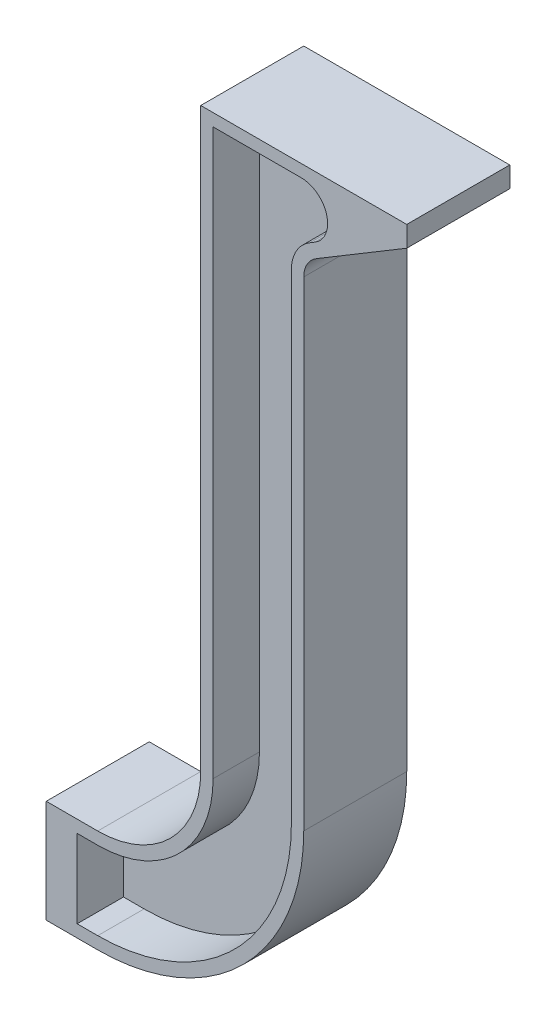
from build123d import *

# Parameters (mm, degrees)
BOSS_EXTRUDE1_DEPTH = 6.35
CUT_EXTRUDE1_DEPTH  = 5.715


with BuildPart() as part:
    # Sketch1 → Boss-Extrude1 (new, symmetric)
    with BuildSketch(Plane.XY):
        with BuildLine():
            Line((0, 0), (25.4, 0))
            Line((25.4, 0), (25.4, -2.54))
            Line((25.4, -2.54), (14.241475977, -9.235114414))
            ThreePointArc((14.241475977, -9.235114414), (13.112115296, -10.393335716), (12.7, -11.957654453))
            Line((12.7, -11.957654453), (12.7, -71.12))
            ThreePointArc((12.7, -71.12), (5.260512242, -89.080512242), (-12.7, -96.52))
            Line((-12.7, -96.52), (-19.05, -96.52))
            Line((-19.05, -96.52), (-19.05, -83.82))
            Line((-19.05, -83.82), (-12.7, -83.82))
            ThreePointArc((-12.7, -83.82), (-3.719743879, -80.100256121), (0, -71.12))
            Line((0, -71.12), (0, 0))
        make_face()
    extrude(amount=BOSS_EXTRUDE1_DEPTH, both=True)

    # Sketch2 → Cut-Extrude1 (cut)
    with BuildSketch(Plane.XY.offset(6.35)):
        with BuildLine():
            Line((-15.24, -85.344), (-15.24, -94.996))
            Line((-15.24, -94.996), (-12.7, -94.996))
            ThreePointArc((-12.7, -94.996), (4.182881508, -88.002881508), (11.176, -71.12))
            Line((11.176, -71.12), (11.176, -11.957654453))
            ThreePointArc((11.176, -11.957654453), (11.785930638, -9.642462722), (13.457384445, -7.928295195))
            Line((13.457384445, -7.928295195), (14.066074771, -7.563081))
            ThreePointArc((14.066074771, -7.563081), (15.526576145, -3.907345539), (12.393346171, -1.524))
            Line((12.393346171, -1.524), (1.524, -1.524))
            Line((1.524, -1.524), (1.524, -71.12))
            ThreePointArc((1.524, -71.12), (-2.642113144, -81.177886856), (-12.7, -85.344))
            Line((-12.7, -85.344), (-15.24, -85.344))
        make_face()
    cut_extrude1 = extrude(amount=-CUT_EXTRUDE1_DEPTH, mode=Mode.SUBTRACT)

    # Mirror1: Cut-Extrude1 across plane
    add(cut_extrude1.mirror(Plane.XY), mode=Mode.SUBTRACT)


solid = part.part
